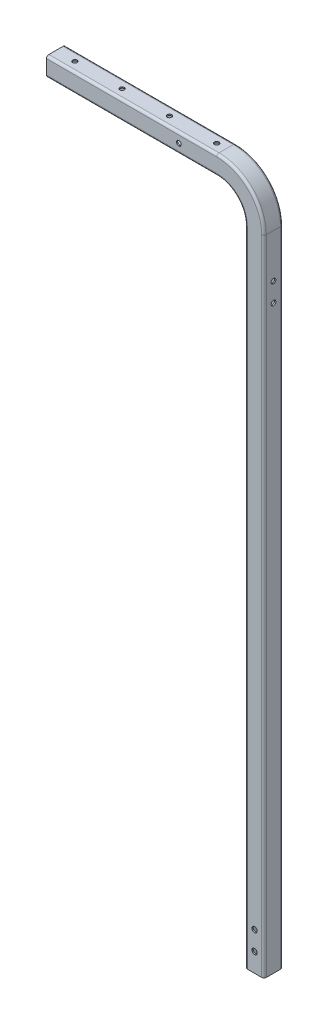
from build123d import *

# Parameters (mm, degrees)
SKETCH2_W                   = 25.4
SKETCH2_H                   = 25.4
FILLET1_R                   = 3.175
SHELL1_T                    = -1.5875
F_6_0_6_DIAMETER_HOLE1_D    = 6
LPATTERN3_COUNT             = 4
LPATTERN3_PITCH             = 63.5
SKETCH5_R                   = 3.175
CONT_MTG_DEPTH              = 961.005760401
F_1_4_0_25_DIAMETER_HOLE1_D = 6.35
SKETCH8_R                   = 3.571875
CUT_EXTRUDE1_DEPTH          = 961.257741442
LPATTERN2_COUNT             = 2
LPATTERN2_PITCH             = 25.4


with BuildPart() as part:
    # Base-Sweep: sweep along a path in Sketch1
    with BuildLine(Plane.XY) as base_sweep_path:
        Line((0, 0), (228.6, 0))
        ThreePointArc((228.6, 0), (264.521024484, -14.878975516), (279.4, -50.8))
        Line((279.4, -50.8), (279.4, -914.4))
    # Sketch2 (on Right Plane) → Base-Sweep (sweep)
    with BuildSketch(Plane(origin=(0, 0, 0), x_dir=(0, 0, -1), z_dir=(1, 0, 0))):
        Rectangle(SKETCH2_W, SKETCH2_H)
    sweep(path=base_sweep_path.line)

    # Fillet1
    fillet1_edges = [part.edges().sort_by_distance(p)[0] for p in [
        (273.501280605, -5.898719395, 12.7),
        (273.501280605, -5.898719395, -12.7),
        (255.540768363, -23.859231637, -12.7),
        (255.540768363, -23.859231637, 12.7),
        (292.1, -482.6, 12.7),
        (292.1, -482.6, -12.7),
        (266.7, -482.6, -12.7),
        (266.7, -482.6, 12.7),
        (114.3, 12.7, 12.7),
        (114.3, 12.7, -12.7),
        (114.3, -12.7, -12.7),
        (114.3, -12.7, 12.7),
    ]]
    fillet(fillet1_edges, radius=FILLET1_R)

    # Shell1
    shell1_openings = [part.faces().sort_by_distance(p)[0] for p in [
        (279.4, -914.4, 0),
        (0, 0, 0),
    ]]
    offset(amount=SHELL1_T, openings=shell1_openings, kind=Kind.INTERSECTION)

    # 6.0 _6_ Diameter Hole1 (through all)
    with Locations(Plane(origin=(0, 12.7, 0), x_dir=(1, 0, 0), z_dir=(0, 1, 0))):
        with Locations((215.9, 0)):
            f_6_0_6_diameter_hole1 = Hole(F_6_0_6_DIAMETER_HOLE1_D / 2)

    # LPattern3: 6.0 _6_ Diameter Hole1 ×4
    with Locations(*[(-i * LPATTERN3_PITCH, 0, 0) for i in range(1, LPATTERN3_COUNT)]):
        add(f_6_0_6_diameter_hole1, mode=Mode.SUBTRACT)

    # Sketch5 → cont_mtg (cut, through all)
    with BuildSketch(Plane(origin=(292.1, 0, 0), x_dir=(0, 0, -1), z_dir=(1, 0, 0))):
        with Locations(Location((0, -109.5375, 0), (0, 0, 90))):
            Circle(SKETCH5_R)
        with Locations(Location((0, -134.9375, 0), (0, 0, 90))):
            Circle(SKETCH5_R)
    extrude(amount=-CONT_MTG_DEPTH, mode=Mode.SUBTRACT)

    # 1_4 _0.25_ Diameter Hole1 (through all)
    with Locations(Plane.XY.offset(12.7)):
        with Locations((177.8, 0), (355.6, 0)):
            Hole(F_1_4_0_25_DIAMETER_HOLE1_D / 2)

    # Sketch8 → Cut-Extrude1 (cut, through all)
    with BuildSketch(Plane(origin=(0, 0, -12.7), x_dir=(-1, 0, 0), z_dir=(0, 0, -1))):
        with Locations(Location((-279.4, -889, 0), (0, 0, 90))):
            Circle(SKETCH8_R)
    cut_extrude1 = extrude(amount=-CUT_EXTRUDE1_DEPTH, mode=Mode.SUBTRACT)

    # LPattern2: Cut-Extrude1 ×2
    with Locations(*[(0, i * LPATTERN2_PITCH, 0) for i in range(1, LPATTERN2_COUNT)]):
        add(cut_extrude1, mode=Mode.SUBTRACT)


solid = part.part
